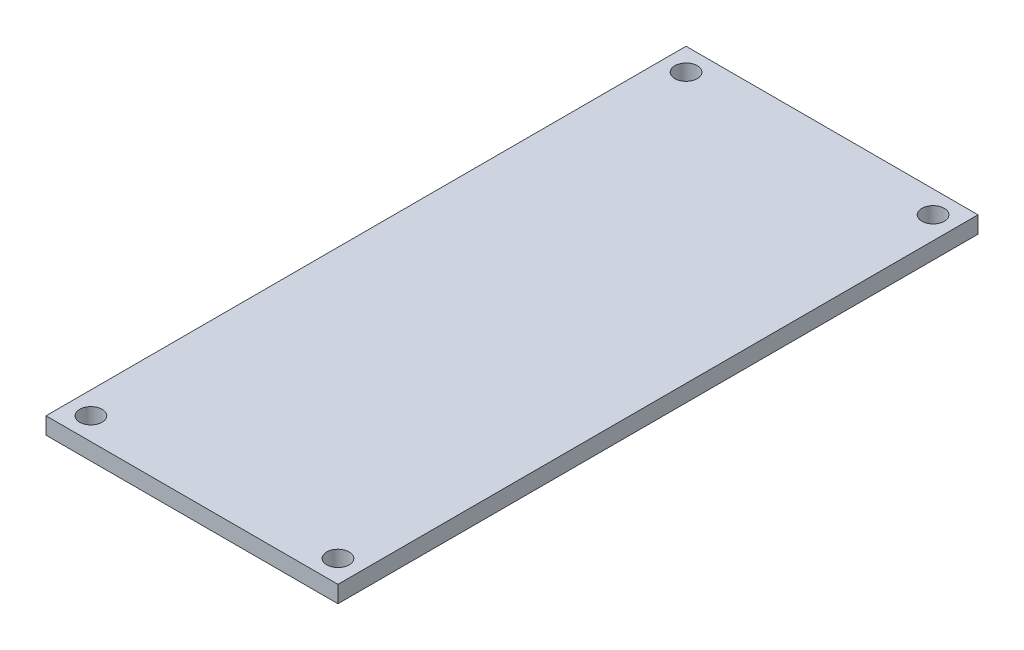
ISO-10303-21;
HEADER;
FILE_DESCRIPTION(('STEP AP214'),'2;1');
FILE_NAME('part.step','',(''),(''),'','','');
FILE_SCHEMA(('AUTOMOTIVE_DESIGN { 1 0 10303 214 1 1 1 1 }'));
ENDSEC;
DATA;
#1=APPLICATION_CONTEXT('core data for automotive mechanical design processes');
#2=APPLICATION_PROTOCOL_DEFINITION('international standard','automotive_design',2000,#1);
#3=PRODUCT_CONTEXT('',#1,'mechanical');
#4=PRODUCT('Part','Part','',(#3));
#5=PRODUCT_RELATED_PRODUCT_CATEGORY('part','',(#4));
#6=PRODUCT_DEFINITION_FORMATION('','',#4);
#7=PRODUCT_DEFINITION_CONTEXT('part definition',#1,'design');
#8=PRODUCT_DEFINITION('design','',#6,#7);
#9=PRODUCT_DEFINITION_SHAPE('','',#8);
#10=(LENGTH_UNIT() NAMED_UNIT(*) SI_UNIT(.MILLI.,.METRE.));
#11=(NAMED_UNIT(*) PLANE_ANGLE_UNIT() SI_UNIT($,.RADIAN.));
#12=(NAMED_UNIT(*) SI_UNIT($,.STERADIAN.) SOLID_ANGLE_UNIT());
#13=UNCERTAINTY_MEASURE_WITH_UNIT(LENGTH_MEASURE(1.E-05),#10,'distance_accuracy_value','');
#14=(GEOMETRIC_REPRESENTATION_CONTEXT(3) GLOBAL_UNCERTAINTY_ASSIGNED_CONTEXT((#13)) GLOBAL_UNIT_ASSIGNED_CONTEXT((#10,
#11,#12)) REPRESENTATION_CONTEXT('',''));
#15=CARTESIAN_POINT('',(0.,0.,0.));
#16=DIRECTION('',(0.,0.,1.));
#17=DIRECTION('',(1.,0.,0.));
#18=AXIS2_PLACEMENT_3D('',#15,#16,#17);
#19=CARTESIAN_POINT('',(0.,1.5,0.));
#20=DIRECTION('',(0.,-1.,0.));
#21=DIRECTION('',(0.,0.,-1.));
#22=AXIS2_PLACEMENT_3D('',#19,#20,#21);
#23=PLANE('',#22);
#24=DIRECTION('',(0.,0.,1.));
#25=VECTOR('',#24,1.);
#26=CARTESIAN_POINT('',(0.,1.5,0.));
#27=LINE('',#26,#25);
#28=CARTESIAN_POINT('',(0.,1.5,-57.));
#29=VERTEX_POINT('',#28);
#30=CARTESIAN_POINT('',(0.,1.5,0.));
#31=VERTEX_POINT('',#30);
#32=EDGE_CURVE('E87',#29,#31,#27,.T.);
#33=ORIENTED_EDGE('',*,*,#32,.T.);
#34=DIRECTION('',(1.,0.,0.));
#35=VECTOR('',#34,1.);
#36=CARTESIAN_POINT('',(0.,1.5,0.));
#37=LINE('',#36,#35);
#38=CARTESIAN_POINT('',(26.,1.5,0.));
#39=VERTEX_POINT('',#38);
#40=EDGE_CURVE('E82',#31,#39,#37,.T.);
#41=ORIENTED_EDGE('',*,*,#40,.T.);
#42=DIRECTION('',(0.,0.,-1.));
#43=VECTOR('',#42,1.);
#44=CARTESIAN_POINT('',(26.,1.5,0.));
#45=LINE('',#44,#43);
#46=CARTESIAN_POINT('',(26.,1.5,-57.));
#47=VERTEX_POINT('',#46);
#48=EDGE_CURVE('E85',#39,#47,#45,.T.);
#49=ORIENTED_EDGE('',*,*,#48,.T.);
#50=DIRECTION('',(-1.,0.,0.));
#51=VECTOR('',#50,1.);
#52=CARTESIAN_POINT('',(0.,1.5,-57.));
#53=LINE('',#52,#51);
#54=EDGE_CURVE('E52',#47,#29,#53,.T.);
#55=ORIENTED_EDGE('',*,*,#54,.T.);
#56=EDGE_LOOP('',(#33,#41,#49,#55));
#57=FACE_BOUND('',#56,.T.);
#58=CARTESIAN_POINT('',(24.,1.5,-2.));
#59=DIRECTION('',(0.,1.,0.));
#60=DIRECTION('',(0.,0.,1.));
#61=AXIS2_PLACEMENT_3D('',#58,#59,#60);
#62=CIRCLE('',#61,1.);
#63=CARTESIAN_POINT('',(24.,1.5,-0.999999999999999));
#64=VERTEX_POINT('',#63);
#65=EDGE_CURVE('E102',#64,#64,#62,.T.);
#66=ORIENTED_EDGE('',*,*,#65,.F.);
#67=EDGE_LOOP('',(#66));
#68=FACE_BOUND('',#67,.T.);
#69=CARTESIAN_POINT('',(2.,1.5,-2.));
#70=DIRECTION('',(0.,1.,0.));
#71=DIRECTION('',(0.,0.,1.));
#72=AXIS2_PLACEMENT_3D('',#69,#70,#71);
#73=CIRCLE('',#72,1.);
#74=CARTESIAN_POINT('',(2.,1.5,-1.));
#75=VERTEX_POINT('',#74);
#76=EDGE_CURVE('E117',#75,#75,#73,.T.);
#77=ORIENTED_EDGE('',*,*,#76,.F.);
#78=EDGE_LOOP('',(#77));
#79=FACE_BOUND('',#78,.T.);
#80=CARTESIAN_POINT('',(2.,1.5,-55.));
#81=DIRECTION('',(0.,1.,0.));
#82=DIRECTION('',(0.,0.,1.));
#83=AXIS2_PLACEMENT_3D('',#80,#81,#82);
#84=CIRCLE('',#83,1.);
#85=CARTESIAN_POINT('',(2.,1.5,-54.));
#86=VERTEX_POINT('',#85);
#87=EDGE_CURVE('E123',#86,#86,#84,.T.);
#88=ORIENTED_EDGE('',*,*,#87,.F.);
#89=EDGE_LOOP('',(#88));
#90=FACE_BOUND('',#89,.T.);
#91=CARTESIAN_POINT('',(24.,1.5,-55.));
#92=DIRECTION('',(0.,1.,0.));
#93=DIRECTION('',(0.,0.,1.));
#94=AXIS2_PLACEMENT_3D('',#91,#92,#93);
#95=CIRCLE('',#94,1.);
#96=CARTESIAN_POINT('',(24.,1.5,-54.));
#97=VERTEX_POINT('',#96);
#98=EDGE_CURVE('E129',#97,#97,#95,.T.);
#99=ORIENTED_EDGE('',*,*,#98,.F.);
#100=EDGE_LOOP('',(#99));
#101=FACE_BOUND('',#100,.T.);
#102=ADVANCED_FACE('F35',(#57,#68,#79,#90,#101),#23,.F.);
#103=CARTESIAN_POINT('',(0.,0.,0.));
#104=DIRECTION('',(0.,-1.,0.));
#105=DIRECTION('',(0.,0.,-1.));
#106=AXIS2_PLACEMENT_3D('',#103,#104,#105);
#107=PLANE('',#106);
#108=CARTESIAN_POINT('',(2.,0.,-55.));
#109=DIRECTION('',(0.,1.,0.));
#110=DIRECTION('',(0.,0.,1.));
#111=AXIS2_PLACEMENT_3D('',#108,#109,#110);
#112=CIRCLE('',#111,1.);
#113=CARTESIAN_POINT('',(2.,0.,-54.));
#114=VERTEX_POINT('',#113);
#115=EDGE_CURVE('E126',#114,#114,#112,.T.);
#116=ORIENTED_EDGE('',*,*,#115,.T.);
#117=EDGE_LOOP('',(#116));
#118=FACE_BOUND('',#117,.T.);
#119=CARTESIAN_POINT('',(24.,0.,-2.));
#120=DIRECTION('',(0.,1.,0.));
#121=DIRECTION('',(0.,0.,1.));
#122=AXIS2_PLACEMENT_3D('',#119,#120,#121);
#123=CIRCLE('',#122,1.);
#124=CARTESIAN_POINT('',(24.,0.,-0.999999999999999));
#125=VERTEX_POINT('',#124);
#126=EDGE_CURVE('E114',#125,#125,#123,.T.);
#127=ORIENTED_EDGE('',*,*,#126,.T.);
#128=EDGE_LOOP('',(#127));
#129=FACE_BOUND('',#128,.T.);
#130=DIRECTION('',(0.,0.,1.));
#131=VECTOR('',#130,1.);
#132=CARTESIAN_POINT('',(0.,0.,0.));
#133=LINE('',#132,#131);
#134=CARTESIAN_POINT('',(0.,0.,-57.));
#135=VERTEX_POINT('',#134);
#136=CARTESIAN_POINT('',(0.,0.,0.));
#137=VERTEX_POINT('',#136);
#138=EDGE_CURVE('E99',#135,#137,#133,.T.);
#139=ORIENTED_EDGE('',*,*,#138,.F.);
#140=DIRECTION('',(-1.,0.,0.));
#141=VECTOR('',#140,1.);
#142=CARTESIAN_POINT('',(0.,0.,-57.));
#143=LINE('',#142,#141);
#144=CARTESIAN_POINT('',(26.,0.,-57.));
#145=VERTEX_POINT('',#144);
#146=EDGE_CURVE('E75',#145,#135,#143,.T.);
#147=ORIENTED_EDGE('',*,*,#146,.F.);
#148=DIRECTION('',(0.,0.,-1.));
#149=VECTOR('',#148,1.);
#150=CARTESIAN_POINT('',(26.,0.,0.));
#151=LINE('',#150,#149);
#152=CARTESIAN_POINT('',(26.,0.,0.));
#153=VERTEX_POINT('',#152);
#154=EDGE_CURVE('E69',#153,#145,#151,.T.);
#155=ORIENTED_EDGE('',*,*,#154,.F.);
#156=DIRECTION('',(1.,0.,0.));
#157=VECTOR('',#156,1.);
#158=CARTESIAN_POINT('',(0.,0.,0.));
#159=LINE('',#158,#157);
#160=EDGE_CURVE('E91',#137,#153,#159,.T.);
#161=ORIENTED_EDGE('',*,*,#160,.F.);
#162=EDGE_LOOP('',(#139,#147,#155,#161));
#163=FACE_BOUND('',#162,.T.);
#164=CARTESIAN_POINT('',(2.,0.,-2.));
#165=DIRECTION('',(0.,1.,0.));
#166=DIRECTION('',(0.,0.,1.));
#167=AXIS2_PLACEMENT_3D('',#164,#165,#166);
#168=CIRCLE('',#167,1.);
#169=CARTESIAN_POINT('',(2.,0.,-1.));
#170=VERTEX_POINT('',#169);
#171=EDGE_CURVE('E120',#170,#170,#168,.T.);
#172=ORIENTED_EDGE('',*,*,#171,.T.);
#173=EDGE_LOOP('',(#172));
#174=FACE_BOUND('',#173,.T.);
#175=CARTESIAN_POINT('',(24.,0.,-55.));
#176=DIRECTION('',(0.,1.,0.));
#177=DIRECTION('',(0.,0.,1.));
#178=AXIS2_PLACEMENT_3D('',#175,#176,#177);
#179=CIRCLE('',#178,1.);
#180=CARTESIAN_POINT('',(24.,0.,-54.));
#181=VERTEX_POINT('',#180);
#182=EDGE_CURVE('E132',#181,#181,#179,.T.);
#183=ORIENTED_EDGE('',*,*,#182,.T.);
#184=EDGE_LOOP('',(#183));
#185=FACE_BOUND('',#184,.T.);
#186=ADVANCED_FACE('F110',(#118,#129,#163,#174,#185),#107,.T.);
#187=CARTESIAN_POINT('',(0.,1.5,0.));
#188=DIRECTION('',(1.,0.,0.));
#189=DIRECTION('',(0.,0.,-1.));
#190=AXIS2_PLACEMENT_3D('',#187,#188,#189);
#191=PLANE('',#190);
#192=ORIENTED_EDGE('',*,*,#138,.T.);
#193=DIRECTION('',(0.,-1.,0.));
#194=VECTOR('',#193,1.);
#195=CARTESIAN_POINT('',(0.,1.5,0.));
#196=LINE('',#195,#194);
#197=EDGE_CURVE('E11',#31,#137,#196,.T.);
#198=ORIENTED_EDGE('',*,*,#197,.F.);
#199=ORIENTED_EDGE('',*,*,#32,.F.);
#200=DIRECTION('',(0.,-1.,0.));
#201=VECTOR('',#200,1.);
#202=CARTESIAN_POINT('',(0.,1.5,-57.));
#203=LINE('',#202,#201);
#204=EDGE_CURVE('E95',#29,#135,#203,.T.);
#205=ORIENTED_EDGE('',*,*,#204,.T.);
#206=EDGE_LOOP('',(#192,#198,#199,#205));
#207=FACE_BOUND('',#206,.T.);
#208=ADVANCED_FACE('F37',(#207),#191,.F.);
#209=CARTESIAN_POINT('',(0.,1.5,0.));
#210=DIRECTION('',(0.,0.,-1.));
#211=DIRECTION('',(-1.,0.,0.));
#212=AXIS2_PLACEMENT_3D('',#209,#210,#211);
#213=PLANE('',#212);
#214=ORIENTED_EDGE('',*,*,#160,.T.);
#215=DIRECTION('',(0.,-1.,0.));
#216=VECTOR('',#215,1.);
#217=CARTESIAN_POINT('',(26.,1.5,0.));
#218=LINE('',#217,#216);
#219=EDGE_CURVE('E44',#39,#153,#218,.T.);
#220=ORIENTED_EDGE('',*,*,#219,.F.);
#221=ORIENTED_EDGE('',*,*,#40,.F.);
#222=ORIENTED_EDGE('',*,*,#197,.T.);
#223=EDGE_LOOP('',(#214,#220,#221,#222));
#224=FACE_BOUND('',#223,.T.);
#225=ADVANCED_FACE('F90',(#224),#213,.F.);
#226=CARTESIAN_POINT('',(26.,1.5,0.));
#227=DIRECTION('',(-1.,0.,0.));
#228=DIRECTION('',(0.,0.,1.));
#229=AXIS2_PLACEMENT_3D('',#226,#227,#228);
#230=PLANE('',#229);
#231=ORIENTED_EDGE('',*,*,#154,.T.);
#232=DIRECTION('',(0.,-1.,0.));
#233=VECTOR('',#232,1.);
#234=CARTESIAN_POINT('',(26.,1.5,-57.));
#235=LINE('',#234,#233);
#236=EDGE_CURVE('E92',#47,#145,#235,.T.);
#237=ORIENTED_EDGE('',*,*,#236,.F.);
#238=ORIENTED_EDGE('',*,*,#48,.F.);
#239=ORIENTED_EDGE('',*,*,#219,.T.);
#240=EDGE_LOOP('',(#231,#237,#238,#239));
#241=FACE_BOUND('',#240,.T.);
#242=ADVANCED_FACE('F93',(#241),#230,.F.);
#243=CARTESIAN_POINT('',(0.,1.5,-57.));
#244=DIRECTION('',(0.,0.,1.));
#245=DIRECTION('',(1.,0.,0.));
#246=AXIS2_PLACEMENT_3D('',#243,#244,#245);
#247=PLANE('',#246);
#248=ORIENTED_EDGE('',*,*,#146,.T.);
#249=ORIENTED_EDGE('',*,*,#204,.F.);
#250=ORIENTED_EDGE('',*,*,#54,.F.);
#251=ORIENTED_EDGE('',*,*,#236,.T.);
#252=EDGE_LOOP('',(#248,#249,#250,#251));
#253=FACE_BOUND('',#252,.T.);
#254=ADVANCED_FACE('F107',(#253),#247,.F.);
#255=CARTESIAN_POINT('',(24.,1.5,-2.));
#256=DIRECTION('',(0.,-1.,0.));
#257=DIRECTION('',(0.,0.,-1.));
#258=AXIS2_PLACEMENT_3D('',#255,#256,#257);
#259=CYLINDRICAL_SURFACE('',#258,1.);
#260=ORIENTED_EDGE('',*,*,#65,.T.);
#261=EDGE_LOOP('',(#260));
#262=FACE_BOUND('',#261,.T.);
#263=ORIENTED_EDGE('',*,*,#126,.F.);
#264=EDGE_LOOP('',(#263));
#265=FACE_BOUND('',#264,.T.);
#266=ADVANCED_FACE('F149',(#262,#265),#259,.F.);
#267=CARTESIAN_POINT('',(2.,1.5,-2.));
#268=DIRECTION('',(0.,-1.,0.));
#269=DIRECTION('',(0.,0.,-1.));
#270=AXIS2_PLACEMENT_3D('',#267,#268,#269);
#271=CYLINDRICAL_SURFACE('',#270,1.);
#272=ORIENTED_EDGE('',*,*,#76,.T.);
#273=EDGE_LOOP('',(#272));
#274=FACE_BOUND('',#273,.T.);
#275=ORIENTED_EDGE('',*,*,#171,.F.);
#276=EDGE_LOOP('',(#275));
#277=FACE_BOUND('',#276,.T.);
#278=ADVANCED_FACE('F197',(#274,#277),#271,.F.);
#279=CARTESIAN_POINT('',(2.,1.5,-55.));
#280=DIRECTION('',(0.,-1.,0.));
#281=DIRECTION('',(0.,0.,-1.));
#282=AXIS2_PLACEMENT_3D('',#279,#280,#281);
#283=CYLINDRICAL_SURFACE('',#282,1.);
#284=ORIENTED_EDGE('',*,*,#87,.T.);
#285=EDGE_LOOP('',(#284));
#286=FACE_BOUND('',#285,.T.);
#287=ORIENTED_EDGE('',*,*,#115,.F.);
#288=EDGE_LOOP('',(#287));
#289=FACE_BOUND('',#288,.T.);
#290=ADVANCED_FACE('F205',(#286,#289),#283,.F.);
#291=CARTESIAN_POINT('',(24.,1.5,-55.));
#292=DIRECTION('',(0.,-1.,0.));
#293=DIRECTION('',(0.,0.,-1.));
#294=AXIS2_PLACEMENT_3D('',#291,#292,#293);
#295=CYLINDRICAL_SURFACE('',#294,1.);
#296=ORIENTED_EDGE('',*,*,#98,.T.);
#297=EDGE_LOOP('',(#296));
#298=FACE_BOUND('',#297,.T.);
#299=ORIENTED_EDGE('',*,*,#182,.F.);
#300=EDGE_LOOP('',(#299));
#301=FACE_BOUND('',#300,.T.);
#302=ADVANCED_FACE('F138',(#298,#301),#295,.F.);
#303=CLOSED_SHELL('',(#102,#186,#208,#225,#242,#254,#266,#278,#290,#302));
#304=MANIFOLD_SOLID_BREP('B2',#303);
#305=ADVANCED_BREP_SHAPE_REPRESENTATION('',(#18,#304),#14);
#306=SHAPE_DEFINITION_REPRESENTATION(#9,#305);
ENDSEC;
END-ISO-10303-21;
